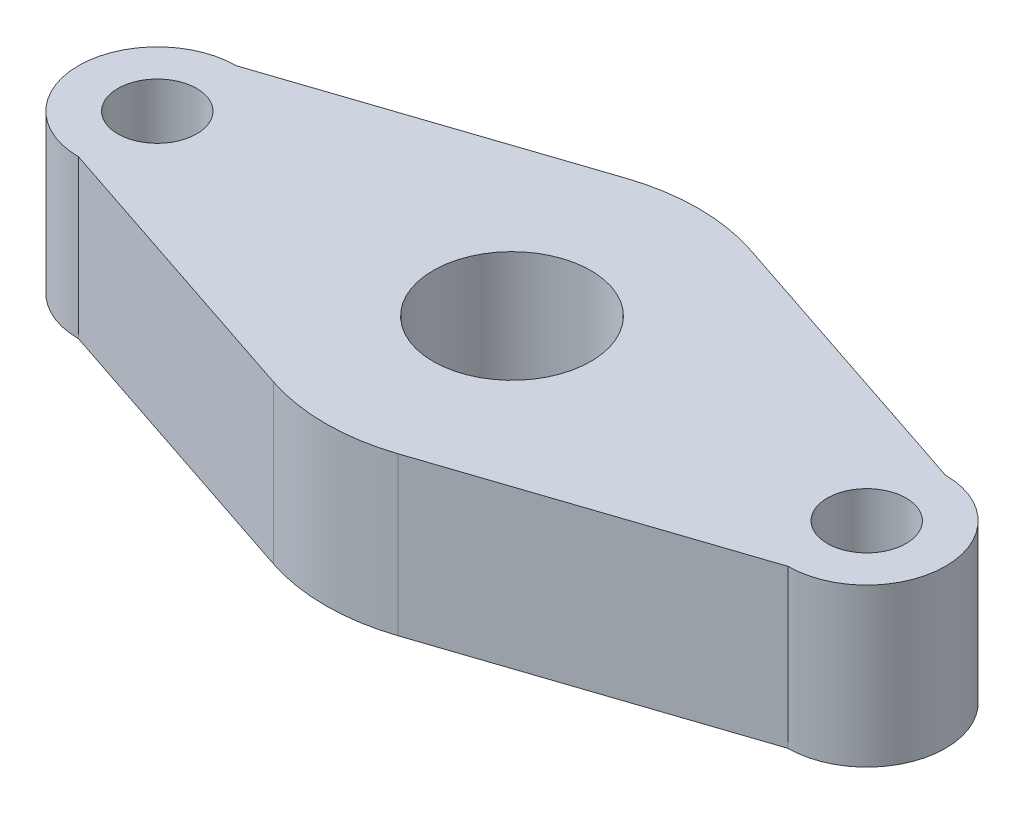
from build123d import *

# Parameters (mm, degrees)
SKETCH3_R           = 12.7
SKETCH3_R_2         = 6.35
BOSS_EXTRUDE1_DEPTH = 25.4


with BuildPart() as part:
    # Sketch3 → Boss-Extrude1 (new body)
    with BuildSketch(Plane(origin=(0, 0, 0), x_dir=(1, 0, 0), z_dir=(0, 1, 0))):
        with BuildLine():
            Line((10.040231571, 28.403256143), (57.15, 12.7))
            ThreePointArc((57.15, 12.7), (69.85, 0), (57.15, -12.7))
            Line((57.15, -12.7), (10.040231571, -28.403256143))
            ThreePointArc((10.040231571, -28.403256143), (0, -30.03256143), (-10.040231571, -28.403256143))
            Line((-10.040231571, -28.403256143), (-57.15, -12.7))
            ThreePointArc((-57.15, -12.7), (-69.85, 0), (-57.15, 12.7))
            Line((-57.15, 12.7), (-10.040231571, 28.403256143))
            ThreePointArc((-10.040231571, 28.403256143), (0, 30.03256143), (10.040231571, 28.403256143))
        make_face()
        with Locations(Location((0, 0, 0), (0, 0, 270))):
            Circle(SKETCH3_R, mode=Mode.SUBTRACT)
        with Locations(Location((57.15, 0, 0), (0, 0, 270))):
            Circle(SKETCH3_R_2, mode=Mode.SUBTRACT)
        with Locations(Location((-57.15, 0, 0), (0, 0, 90))):
            Circle(SKETCH3_R_2, mode=Mode.SUBTRACT)
    extrude(amount=BOSS_EXTRUDE1_DEPTH)


solid = part.part
